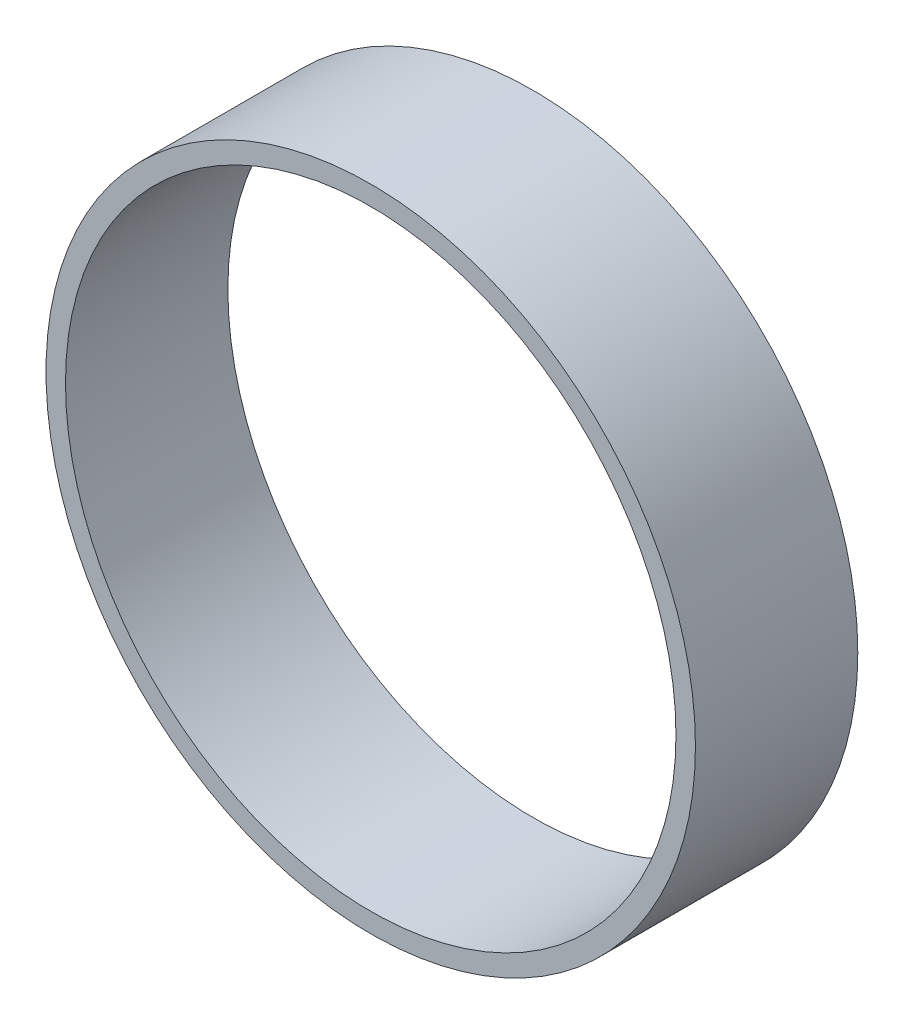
from build123d import *

# Parameters (mm, degrees)
ESQUISSE1_R        = 50
ESQUISSE1_R_2      = 47
BOSS_EXTRU_1_DEPTH = 25


with BuildPart() as part:
    # Esquisse1 → Boss.-Extru.1 (new body)
    with BuildSketch(Plane.XY):
        Circle(ESQUISSE1_R)
        Circle(ESQUISSE1_R_2, mode=Mode.SUBTRACT)
    extrude(amount=BOSS_EXTRU_1_DEPTH)


solid = part.part
